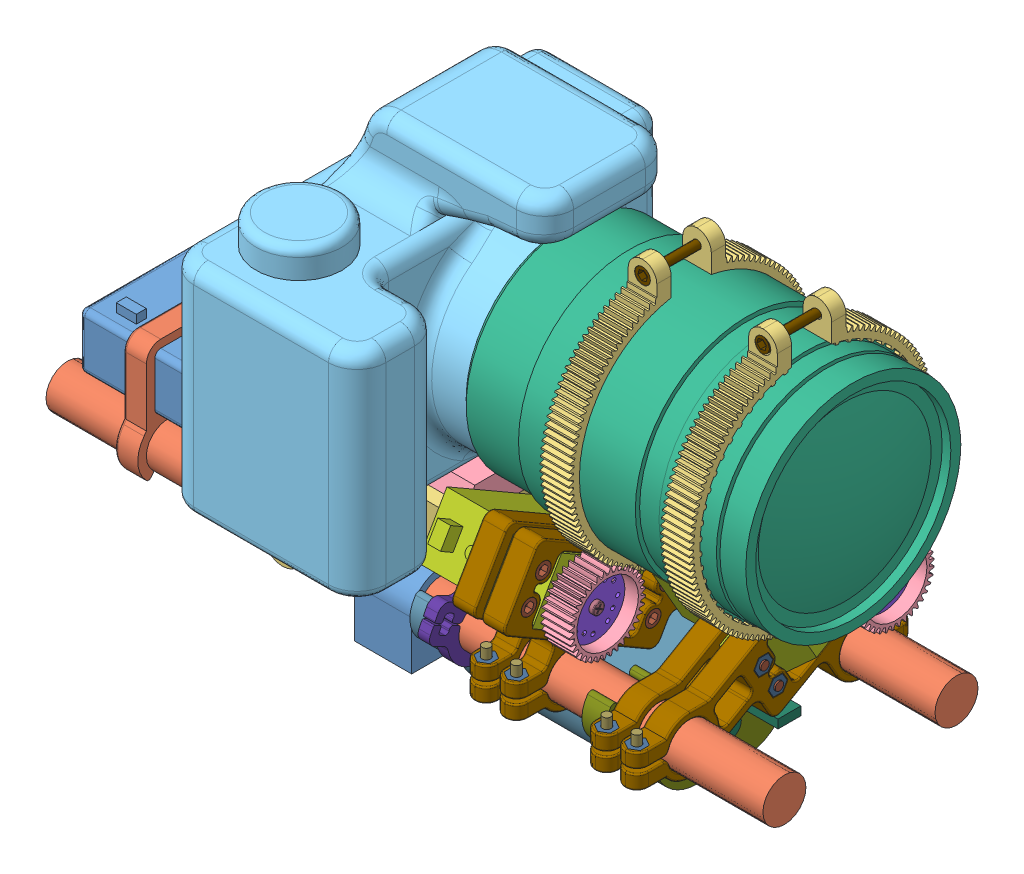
SolidWorks assembly Zocus General Assembly.SLDASM, configuration Default (file format 7000). Lengths in mm.
Overall size (250 175.02 144.67).
70 component instances, 22 part files, 23 mates.
Components (placement in the parent):
- Rail-Rig-GA-1: Rail-Rig-GA.SLDASM [Default] at origin size (250 60 100)
  - Rail Hub-1: Rail Hub.SLDPRT [Default] at origin size (20 27 80)
  - 15mm Rail-1: 15mm Rail.SLDPRT [Default] at (15 3.5 30) size (250 15 15)
  - 15mm Rail-2: 15mm Rail.SLDPRT [Default] at (15 3.5 -30) size (250 15 15)
  - Rail-Rig-Centre-1: Rail-Rig-Centre.SLDPRT [Default] at (-5 16.5 0) x (0 0 -1) z (1 0 0) size (90 55 60)
  - Rail-Rig-DSLR-Shoe-1: Rail-Rig-DSLR-Shoe.SLDPRT [Default] at (-36 31.5 0) size (60 10 50)
- 550D-RebelT2i-Body-1: 550D-RebelT2i-Body.SLDPRT [Default] at (-4.5 36 15) x (0 0 1) z (-1 0 0) size (130 96.5 75)
- Tamron-At28mm-1: Tamron-At28mm.SLDPRT [Default] at (34 74 0) size (101.59 78 78)
- Servo-Asm-F-1: Servo-Asm-F.SLDASM [Default] at (65 28 29.1562) x (0 -0.5 -0.866025) z (0 -0.866025 0.5) size (115.17 49.5 98.53)
  - Servo SM-S4303R-1: Servo SM-S4303R.SLDPRT [Default] at origin size (56 46 20.51)
  - Servo SM-S4303R - SmallWheel1-1: Servo SM-S4303R - SmallWheel1.SLDPRT [Default] at (0 8 0) size (21 5.7 21)
  - Servo Mount-1: Servo Mount.SLDPRT [Default] at (37.5 -8 6.6395) x (0 1 0) z (-0.866025 0 0.5) size (8 55.49 100.95)
  - Servo Mount-3: Servo Mount.SLDPRT [Default] at (37.5 -18.5 6.6395) x (0 1 0) z (-0.866025 0 0.5) size (8 55.49 100.95)
  - M3 Nut-1: M3 Nut.SLDPRT [Default] at (35.5 -18.5 -5.2887) size (5.5 2.3 6.35)
  - M3 Nut-2: M3 Nut.SLDPRT [Default] at (35.5 -18.5 4.7113) size (5.5 2.3 6.35)
  - M3 Nut-3: M3 Nut.SLDPRT [Default] at (-14.5 -18.5 -5.2887) size (5.5 2.3 6.35)
  - M3 Nut-4: M3 Nut.SLDPRT [Default] at (-14.5 -18.5 4.7113) size (5.5 2.3 6.35)
  - M3x16-1: M3x16.SLDPRT [Default] at (35.5 -3 4.7113) x (-0.837169 0 -0.546944) z (-0.546944 0 0.837169) size (5.35 19 5.35)
  - M3x16-2: M3x16.SLDPRT [Default] at (-14.5 -3 4.7113) x (-0.837169 0 -0.546944) z (-0.546944 0 0.837169) size (5.35 19 5.35)
  - M3x16-3: M3x16.SLDPRT [Default] at (-14.5 -3 -5.2887) x (-0.837169 0 -0.546944) z (-0.546944 0 0.837169) size (5.35 19 5.35)
  - M3x16-4: M3x16.SLDPRT [Default] at (35.5 -3 -5.2887) x (-0.837169 0 -0.546944) z (-0.546944 0 0.837169) size (5.35 19 5.35)
  - M3 Nut-5: M3 Nut.SLDPRT [Default] at (-3.8806 -14.5 23.8911) x (0.75 -0.5 -0.433013) z (-0.433013 -0.866025 0.25) size (5.5 2.3 6.35)
  - M3 Nut-6: M3 Nut.SLDPRT [Default] at (-3.8806 -4 23.8911) x (0.75 -0.5 -0.433013) z (-0.433013 -0.866025 0.25) size (5.5 2.3 6.35)
  - M3 Nut-7: M3 Nut.SLDPRT [Default] at (73.1306 -14.5 -20.5713) x (0.75 -0.5 -0.433013) z (-0.433013 -0.866025 0.25) size (5.5 2.3 6.35)
  - M3 Nut-8: M3 Nut.SLDPRT [Default] at (73.1306 -4 -20.5713) x (0.75 -0.5 -0.433013) z (-0.433013 -0.866025 0.25) size (5.5 2.3 6.35)
  - M3x12-1: M3x12.SLDPRT [Default] at (0.3694 -4 31.2523) x (0.75 0.5 -0.433013) z (-0.433013 0.866025 0.25) size (5.35 15 5.35)
  - M3x12-2: M3x12.SLDPRT [Default] at (0.3694 -14.5 31.2523) x (0.75 0.5 -0.433013) z (-0.433013 0.866025 0.25) size (5.35 15 5.35)
  - M3x12-3: M3x12.SLDPRT [Default] at (77.3806 -14.5 -13.2101) x (0.75 0.5 -0.433013) z (-0.433013 0.866025 0.25) size (5.35 15 5.35)
  - M3x12-4: M3x12.SLDPRT [Default] at (77.3806 -4 -13.2101) x (0.75 0.5 -0.433013) z (-0.433013 0.866025 0.25) size (5.35 15 5.35)
  - Servo Screw-1: Servo Screw.SLDPRT [Default] at (0 5 0) size (4 4.5 4)
- BM Assy-2: BM Assy.SLDASM [Default] at (55.779 -10.2726 -0.0081) x (1 0 0) z (0 0 -1) size (81 38.84 81.25)
  - Blend Micro Box-1: Blend Micro Box.SLDPRT [Default] at (-35.779 5.7274 -0.0081) x (0 0 -1) z (0 -1 0) size (81.25 60 38.84)
  - Blend Micro PCB V3-2: Blend Micro PCB V3.SLDPRT [Default] at (0.221 -0.2726 -0.0081) size (76.75 16 40)
  - Blend Micro Box Lid-1: Blend Micro Box Lid.SLDPRT [Default] at (32.221 5.7274 -0.0081) x (0 0 1) z (0 -1 0) size (81.25 11 38.8)
- Servo-Asm-R-3: Servo-Asm-R.SLDASM [Default] at (88.5 28 -29.1562) x (0 -0.5 0.866025) z (0 -0.866025 -0.5) size (115.17 49.5 98.53)
  - Servo SM-S4303R - SmallWheel1-1: Servo SM-S4303R - SmallWheel1.SLDPRT [Default] at (-0.5 -26.5 -0.2887) x (-0.837169 0 -0.546944) z (-0.546944 0 0.837169) size (21 5.7 21)
  - Servo Mount-1: Servo Mount.SLDPRT [Default] at (37.5 -8 6.6395) x (0 1 0) z (-0.866025 0 0.5) size (8 55.49 100.95)
  - Servo Mount-3: Servo Mount.SLDPRT [Default] at (37.5 -18.5 6.6395) x (0 1 0) z (-0.866025 0 0.5) size (8 55.49 100.95)
  - M3 Nut-1: M3 Nut.SLDPRT [Default] at (35.5 -18.5 -5.2887) size (5.5 2.3 6.35)
  - M3 Nut-2: M3 Nut.SLDPRT [Default] at (35.5 -18.5 4.7113) size (5.5 2.3 6.35)
  - M3 Nut-3: M3 Nut.SLDPRT [Default] at (-14.5 -18.5 -5.2887) size (5.5 2.3 6.35)
  - M3 Nut-4: M3 Nut.SLDPRT [Default] at (-14.5 -18.5 4.7113) size (5.5 2.3 6.35)
  - M3x16-1: M3x16.SLDPRT [Default] at (35.5 -3 4.7113) x (-0.837169 0 -0.546944) z (-0.546944 0 0.837169) size (5.35 19 5.35)
  - M3x16-2: M3x16.SLDPRT [Default] at (-14.5 -3 4.7113) x (-0.837169 0 -0.546944) z (-0.546944 0 0.837169) size (5.35 19 5.35)
  - M3x16-3: M3x16.SLDPRT [Default] at (-14.5 -3 -5.2887) x (-0.837169 0 -0.546944) z (-0.546944 0 0.837169) size (5.35 19 5.35)
  - M3x16-4: M3x16.SLDPRT [Default] at (35.5 -3 -5.2887) x (-0.837169 0 -0.546944) z (-0.546944 0 0.837169) size (5.35 19 5.35)
  - M3 Nut-5: M3 Nut.SLDPRT [Default] at (-3.8806 -14.5 23.8911) x (0.75 -0.5 -0.433013) z (-0.433013 -0.866025 0.25) size (5.5 2.3 6.35)
  - M3 Nut-6: M3 Nut.SLDPRT [Default] at (-3.8806 -4 23.8911) x (0.75 -0.5 -0.433013) z (-0.433013 -0.866025 0.25) size (5.5 2.3 6.35)
  - M3 Nut-7: M3 Nut.SLDPRT [Default] at (73.1306 -14.5 -20.5713) x (0.75 -0.5 -0.433013) z (-0.433013 -0.866025 0.25) size (5.5 2.3 6.35)
  - M3 Nut-8: M3 Nut.SLDPRT [Default] at (73.1306 -4 -20.5713) x (0.75 -0.5 -0.433013) z (-0.433013 -0.866025 0.25) size (5.5 2.3 6.35)
  - M3x12-1: M3x12.SLDPRT [Default] at (0.3694 -4 31.2523) x (0.75 0.5 -0.433013) z (-0.433013 0.866025 0.25) size (5.35 15 5.35)
  - M3x12-2: M3x12.SLDPRT [Default] at (0.3694 -14.5 31.2523) x (0.75 0.5 -0.433013) z (-0.433013 0.866025 0.25) size (5.35 15 5.35)
  - M3x12-3: M3x12.SLDPRT [Default] at (77.3806 -14.5 -13.2101) x (0.75 0.5 -0.433013) z (-0.433013 0.866025 0.25) size (5.35 15 5.35)
  - M3x12-4: M3x12.SLDPRT [Default] at (77.3806 -4 -13.2101) x (0.75 0.5 -0.433013) z (-0.433013 0.866025 0.25) size (5.35 15 5.35)
  - Servo SM-S4303R-2: Servo SM-S4303R.SLDPRT [Default] at (-0.5 -18.5 -0.2887) x (1 0 0) z (0 0 -1) size (56 46 20.51)
  - Servo Screw-1: Servo Screw.SLDPRT [Default] at (-0.5 -23.5 -0.2887) x (-0.837169 0 -0.546944) z (-0.546944 0 0.837169) size (4 4.5 4)
- Cable Loop-1: Cable Loop.SLDPRT [Default] at (34 3.5 30) x (0 0.446715 0.894676) z (0 -0.894676 0.446715) size (29.5 4 23)
- M3 Nut-1: M3 Nut.SLDPRT [Default] at (114 118.989 -9.7509) x (0.866025 -0.5 0.000566) z (0.5 0.866025 -0.00098) size (5.5 2.3 6.35)
- M3x20-1: M3x20.SLDPRT [Default] at (114 119.0102 8.9491) x (1 0 0) z (0 0.999999 -0.001132) size (5.35 23 5.35)
- Cable Loop-2: Cable Loop.SLDPRT [Default] at (34 3.5 -30) x (0 0.881322 -0.472516) z (0 0.472516 0.881322) size (29.5 4 23)
- M3 Nut-2: M3 Nut.SLDPRT [Default] at (72.5 118.9844 -9.7722) x (0.866025 0.499999 -0.000802) z (-0.5 0.866024 -0.00139) size (5.5 2.3 6.35)
- M3x20-2: M3x20.SLDPRT [Default] at (72.5 119.0144 8.9278) x (1 0 0) z (0 0.999999 -0.001605) size (5.35 23 5.35)
- Battery AAx4 Assy-1: Battery AAx4 Assy.SLDASM [Default] at (-37 14.125 34.5) x (0 0 -1) z (1 0 0) size (81 40.78 99.5)
  - Battery Pack-1: Battery Pack.SLDPRT [Default] at origin size (69 22.5 99.5)
  - AAx4 - Battery Clip-1: AAx4 - Battery Clip.SLDPRT [Default] at (34.5 9.625 -38) x (0 0 -1) z (-1 0 0) size (8 40.53 81)
  - AAx4 - Battery Clip-2: AAx4 - Battery Clip.SLDPRT [Default] at (34.5 9.625 -13) x (0 0 1) z (1 0 0) size (8 40.53 81)
- Lens Gear for Tamron 28-300mm-3: Lens Gear for Tamron 28-300mm.SLDPRT [Metric - Spur gear 0.7M 120T 20PA 10FW ---S120N75H50L80N] at (67.5 74 0) x (1 0 0) z (0 0 -1) size (10 92.69 85.38)
- Lens Gear for Tamron 28-300mm-4: Lens Gear for Tamron 28-300mm.SLDPRT [Metric - Spur gear 0.7M 120T 20PA 10FW ---S120N75H50L80N] at (109.5 74 0) x (1 0 0) z (0 0 -1) size (10 92.69 85.38)
- Servo Gear V1-5: Servo Gear V1.SLDPRT [Metric - Spur gear 0.7M 36T 20PA 10FW ---S36N75H50L22N] at (67.5 28 29.1562) size (10 26.53 26.53)
- Servo Gear V1-6: Servo Gear V1.SLDPRT [Metric - Spur gear 0.7M 36T 20PA 10FW ---S36N75H50L22N] at (109.5 28.5 -29.4449) size (10 26.53 26.53)
Mates (geometry in assembly coordinates):
- Coincident1: coincident anti-aligned: plane of Rail-Rig-GA-1/Rail-Rig-DSLR-Shoe-1 through (24 36.5 25) normal (0 1 0); plane of 550D-RebelT2i-Body-1 through (-4.5 36.5 15) normal (0 -1 0)
- Distance5: distance = 10 mm aligned: plane of Rail-Rig-GA-1/Rail-Rig-Centre-1 through (-36 16.5 0) normal (-1 0 0); plane of 550D-RebelT2i-Body-1 through (-26 111 -50) normal (-1 0 0)
- Coincident3: coincident anti-aligned: plane of Rail-Rig-GA-1/Rail-Rig-Centre-1 through (24 16.5 30) normal (0 0 1); plane of 550D-RebelT2i-Body-1 through (34 36.5 30) normal (0 0 -1)
- Coincident8: coincident anti-aligned: plane of 550D-RebelT2i-Body-1 through (34 74 0) normal (1 0 0); plane of Tamron-At28mm-1 through (34 74 0) normal (-1 0 0)
- Concentric3: concentric aligned: cylinder of 550D-RebelT2i-Body-1 through (34 74 0) axis (-1 0 0) radius 35; cylinder of Tamron-At28mm-1 through (56 74 0) axis (-1 0 0) radius 37
- Concentric8: concentric aligned: cylinder of Rail-Rig-GA-1/15mm Rail-1 through (140 3.5 30) axis (-1 0 0) radius 7.5; cylinder of Servo-Asm-F-1/Servo Mount-1 through (65 3.5 30) axis (-1 0 0) radius 7.5
- Concentric9: concentric aligned: cylinder of Rail-Rig-GA-1/15mm Rail-2 through (140 3.5 -30) axis (-1 0 0) radius 7.5; cylinder of Servo-Asm-F-1/Servo Mount-1 through (65 3.5 -30) axis (-1 0 0) radius 7.5
- Distance3: distance anti-aligned: plane of BM Assy-2/Blend Micro Box-1 through (20 -16 0) normal (-1 0 0); plane of Rail-Rig-GA-1/Rail Hub-1 through (20 3.5 -30) normal (1 0 0)
- Concentric17: concentric aligned: cylinder of Rail-Rig-GA-1/15mm Rail-2 through (140 3.5 -30) axis (-1 0 0) radius 7.5; cylinder of BM Assy-2/Blend Micro Box-1 through (28 3.5 -30) axis (-1 0 0) radius 7.625
- Concentric18: concentric aligned: cylinder of Rail-Rig-GA-1/15mm Rail-1 through (140 3.5 30) axis (-1 0 0) radius 7.5; cylinder of BM Assy-2/Blend Micro Box-1 through (28 3.5 30) axis (-1 0 0) radius 7.625
- Distance6: distance = 1 mm anti-aligned: plane of Servo-Asm-F-1/Servo SM-S4303R-1 through (25 28 29.1562) normal (-1 0 0); plane of Rail-Rig-GA-1/Rail-Rig-Centre-1 through (24 16.5 0) normal (1 0 0)
- Concentric25: concentric anti-aligned: cylinder of Rail-Rig-GA-1/15mm Rail-1 through (140 3.5 30) axis (-1 0 0) radius 7.5; cylinder of Cable Loop-1 through (30 3.5 30) axis (1 0 0) radius 7.5
- Distance9: distance aligned: plane of Cable Loop-1 through (30 3.5 30) normal (-1 0 0); plane of Cable Loop-2 through (30 3.5 -30) normal (-1 0 0)
- Concentric26: concentric anti-aligned: cylinder of Rail-Rig-GA-1/15mm Rail-2 through (140 3.5 -30) axis (-1 0 0) radius 7.5; cylinder of Cable Loop-2 through (30 3.5 -30) axis (1 0 0) radius 7.5
- Distance10: distance = 140 mm aligned: plane of Cable Loop-2 through (30 3.5 -30) normal (-1 0 0); plane of Rail-Rig-GA-1/15mm Rail-2 through (-110 3.5 -30) normal (-1 0 0)
- Distance13: distance = 2 mm anti-aligned: plane of Servo-Asm-R-3/Servo SM-S4303R-2 through (67 28.5 -29.4449) normal (-1 0 0); plane of Servo-Asm-F-1/Servo Mount-1 through (65 3.5 0) normal (1 0 0)
- Concentric29: concentric anti-aligned: cylinder of Rail-Rig-GA-1/15mm Rail-1 through (140 3.5 30) axis (-1 0 0) radius 7.5; cylinder of Servo-Asm-R-3/Servo Mount-3 through (99 3.5 30) axis (1 0 0) radius 7.5
- Concentric30: concentric anti-aligned: cylinder of Rail-Rig-GA-1/15mm Rail-2 through (140 3.5 -30) axis (-1 0 0) radius 7.5; cylinder of Servo-Asm-R-3/Servo Mount-3 through (99 3.5 -30) axis (1 0 0) radius 7.5
- Distance15: distance = 17 mm anti-aligned: plane of Battery AAx4 Assy-1/Battery Pack-1 through (-37 14.125 -34.5) normal (1 0 0); plane of Rail-Rig-GA-1/Rail-Rig-Centre-1 through (-20 -23.5 -20) normal (-1 0 0)
- Concentric41: concentric anti-aligned: cylinder of Rail-Rig-GA-1/15mm Rail-2 through (140 3.5 -30) axis (-1 0 0) radius 7.5; cylinder of Battery AAx4 Assy-1/AAx4 - Battery Clip-1 through (-83 3.5 -30) axis (1 0 0) radius 7.5
- Concentric42: concentric aligned: cylinder of Rail-Rig-GA-1/15mm Rail-1 through (140 3.5 30) axis (-1 0 0) radius 7.5; cylinder of Battery AAx4 Assy-1/AAx4 - Battery Clip-2 through (-42 3.5 30) axis (-1 0 0) radius 7.5
- Coincident11: coincident aligned: plane of ? through (77.5 28 29.1562) normal (1 0 0); plane of Lens Gear for Tamron 28-300mm-3 through (77.5 74 0) normal (1 0 0)
- Coincident13: coincident aligned: plane of ? through (119.5 28.5 -29.4449) normal (1 0 0); plane of Lens Gear for Tamron 28-300mm-4 through (119.5 74 0) normal (1 0 0)
